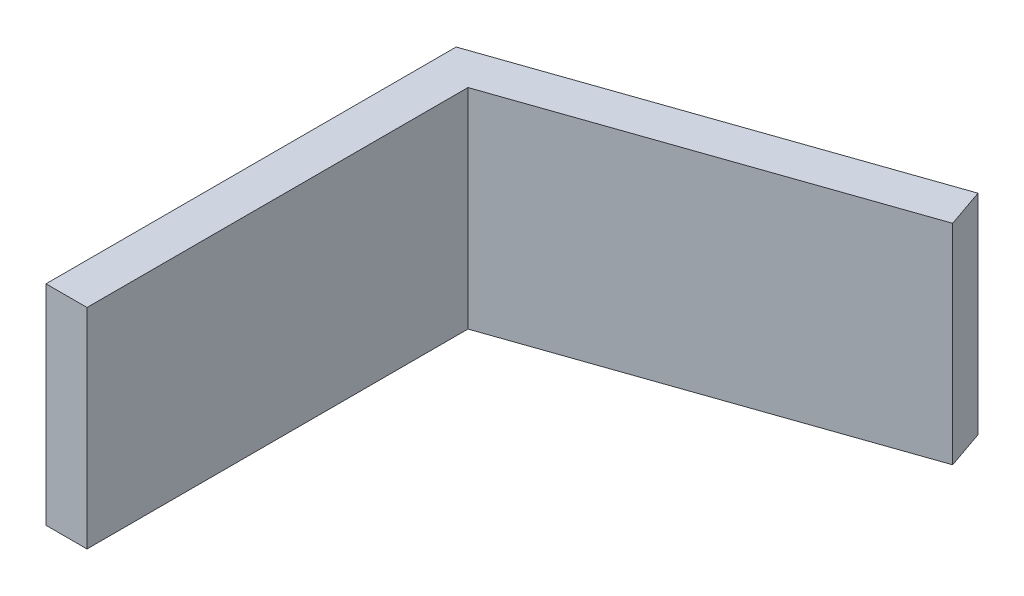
ISO-10303-21;
HEADER;
FILE_DESCRIPTION(('STEP AP214'),'2;1');
FILE_NAME('part.step','',(''),(''),'','','');
FILE_SCHEMA(('AUTOMOTIVE_DESIGN { 1 0 10303 214 1 1 1 1 }'));
ENDSEC;
DATA;
#1=APPLICATION_CONTEXT('core data for automotive mechanical design processes');
#2=APPLICATION_PROTOCOL_DEFINITION('international standard','automotive_design',2000,#1);
#3=PRODUCT_CONTEXT('',#1,'mechanical');
#4=PRODUCT('Part','Part','',(#3));
#5=PRODUCT_RELATED_PRODUCT_CATEGORY('part','',(#4));
#6=PRODUCT_DEFINITION_FORMATION('','',#4);
#7=PRODUCT_DEFINITION_CONTEXT('part definition',#1,'design');
#8=PRODUCT_DEFINITION('design','',#6,#7);
#9=PRODUCT_DEFINITION_SHAPE('','',#8);
#10=(LENGTH_UNIT() NAMED_UNIT(*) SI_UNIT(.MILLI.,.METRE.));
#11=(NAMED_UNIT(*) PLANE_ANGLE_UNIT() SI_UNIT($,.RADIAN.));
#12=(NAMED_UNIT(*) SI_UNIT($,.STERADIAN.) SOLID_ANGLE_UNIT());
#13=UNCERTAINTY_MEASURE_WITH_UNIT(LENGTH_MEASURE(1.E-05),#10,'distance_accuracy_value','');
#14=(GEOMETRIC_REPRESENTATION_CONTEXT(3) GLOBAL_UNCERTAINTY_ASSIGNED_CONTEXT((#13)) GLOBAL_UNIT_ASSIGNED_CONTEXT((#10,
#11,#12)) REPRESENTATION_CONTEXT('',''));
#15=CARTESIAN_POINT('',(0.,0.,0.));
#16=DIRECTION('',(0.,0.,1.));
#17=DIRECTION('',(1.,0.,0.));
#18=AXIS2_PLACEMENT_3D('',#15,#16,#17);
#19=CARTESIAN_POINT('',(-5.00000000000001,25.5,-91.1175916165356));
#20=DIRECTION('',(0.327543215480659,0.,0.944836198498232));
#21=DIRECTION('',(0.944836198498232,0.,-0.327543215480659));
#22=AXIS2_PLACEMENT_3D('',#19,#20,#21);
#23=PLANE('',#22);
#24=DIRECTION('',(-0.944836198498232,0.,0.327543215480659));
#25=VECTOR('',#24,1.);
#26=CARTESIAN_POINT('',(-5.00000000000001,-25.5,-91.1175916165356));
#27=LINE('',#26,#25);
#28=CARTESIAN_POINT('',(89.4836198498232,-25.5,-123.871913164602));
#29=VERTEX_POINT('',#28);
#30=CARTESIAN_POINT('',(-5.00000000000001,-25.5,-91.1175916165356));
#31=VERTEX_POINT('',#30);
#32=EDGE_CURVE('E121',#29,#31,#27,.T.);
#33=ORIENTED_EDGE('',*,*,#32,.T.);
#34=DIRECTION('',(0.,-1.,0.));
#35=VECTOR('',#34,1.);
#36=CARTESIAN_POINT('',(-5.00000000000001,25.5,-91.1175916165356));
#37=LINE('',#36,#35);
#38=CARTESIAN_POINT('',(-5.00000000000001,25.5,-91.1175916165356));
#39=VERTEX_POINT('',#38);
#40=EDGE_CURVE('E11',#39,#31,#37,.T.);
#41=ORIENTED_EDGE('',*,*,#40,.F.);
#42=DIRECTION('',(-0.944836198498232,0.,0.327543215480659));
#43=VECTOR('',#42,1.);
#44=CARTESIAN_POINT('',(-5.00000000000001,25.5,-91.1175916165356));
#45=LINE('',#44,#43);
#46=CARTESIAN_POINT('',(89.4836198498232,25.5,-123.871913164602));
#47=VERTEX_POINT('',#46);
#48=EDGE_CURVE('E131',#47,#39,#45,.T.);
#49=ORIENTED_EDGE('',*,*,#48,.F.);
#50=DIRECTION('',(0.,-1.,0.));
#51=VECTOR('',#50,1.);
#52=CARTESIAN_POINT('',(89.4836198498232,25.5,-123.871913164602));
#53=LINE('',#52,#51);
#54=EDGE_CURVE('E117',#47,#29,#53,.T.);
#55=ORIENTED_EDGE('',*,*,#54,.T.);
#56=EDGE_LOOP('',(#33,#41,#49,#55));
#57=FACE_BOUND('',#56,.T.);
#58=ADVANCED_FACE('F37',(#57),#23,.F.);
#59=CARTESIAN_POINT('',(-5.00000000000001,25.5,-91.1175916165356));
#60=DIRECTION('',(1.,0.,0.));
#61=DIRECTION('',(0.,0.,-1.));
#62=AXIS2_PLACEMENT_3D('',#59,#60,#61);
#63=PLANE('',#62);
#64=DIRECTION('',(0.,0.,1.));
#65=VECTOR('',#64,1.);
#66=CARTESIAN_POINT('',(-5.00000000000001,-25.5,-91.1175916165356));
#67=LINE('',#66,#65);
#68=CARTESIAN_POINT('',(-5.,-25.5,8.88240838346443));
#69=VERTEX_POINT('',#68);
#70=EDGE_CURVE('E124',#31,#69,#67,.T.);
#71=ORIENTED_EDGE('',*,*,#70,.T.);
#72=DIRECTION('',(0.,-1.,0.));
#73=VECTOR('',#72,1.);
#74=CARTESIAN_POINT('',(-5.,25.5,8.88240838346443));
#75=LINE('',#74,#73);
#76=CARTESIAN_POINT('',(-5.,25.5,8.88240838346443));
#77=VERTEX_POINT('',#76);
#78=EDGE_CURVE('E45',#77,#69,#75,.T.);
#79=ORIENTED_EDGE('',*,*,#78,.F.);
#80=DIRECTION('',(0.,0.,1.));
#81=VECTOR('',#80,1.);
#82=CARTESIAN_POINT('',(-5.00000000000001,25.5,-91.1175916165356));
#83=LINE('',#82,#81);
#84=EDGE_CURVE('E90',#39,#77,#83,.T.);
#85=ORIENTED_EDGE('',*,*,#84,.F.);
#86=ORIENTED_EDGE('',*,*,#40,.T.);
#87=EDGE_LOOP('',(#71,#79,#85,#86));
#88=FACE_BOUND('',#87,.T.);
#89=ADVANCED_FACE('F155',(#88),#63,.F.);
#90=CARTESIAN_POINT('',(-5.,25.5,8.88240838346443));
#91=DIRECTION('',(0.,0.,-1.));
#92=DIRECTION('',(-1.,0.,0.));
#93=AXIS2_PLACEMENT_3D('',#90,#91,#92);
#94=PLANE('',#93);
#95=DIRECTION('',(1.,0.,0.));
#96=VECTOR('',#95,1.);
#97=CARTESIAN_POINT('',(-5.,-25.5,8.88240838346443));
#98=LINE('',#97,#96);
#99=CARTESIAN_POINT('',(4.99999999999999,-25.5,8.88240838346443));
#100=VERTEX_POINT('',#99);
#101=EDGE_CURVE('E126',#69,#100,#98,.T.);
#102=ORIENTED_EDGE('',*,*,#101,.T.);
#103=DIRECTION('',(0.,-1.,0.));
#104=VECTOR('',#103,1.);
#105=CARTESIAN_POINT('',(4.99999999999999,25.5,8.88240838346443));
#106=LINE('',#105,#104);
#107=CARTESIAN_POINT('',(4.99999999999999,25.5,8.88240838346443));
#108=VERTEX_POINT('',#107);
#109=EDGE_CURVE('E112',#108,#100,#106,.T.);
#110=ORIENTED_EDGE('',*,*,#109,.F.);
#111=DIRECTION('',(1.,0.,0.));
#112=VECTOR('',#111,1.);
#113=CARTESIAN_POINT('',(-5.,25.5,8.88240838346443));
#114=LINE('',#113,#112);
#115=EDGE_CURVE('E103',#77,#108,#114,.T.);
#116=ORIENTED_EDGE('',*,*,#115,.F.);
#117=ORIENTED_EDGE('',*,*,#78,.T.);
#118=EDGE_LOOP('',(#102,#110,#116,#117));
#119=FACE_BOUND('',#118,.T.);
#120=ADVANCED_FACE('F137',(#119),#94,.F.);
#121=CARTESIAN_POINT('',(5.,25.5,-84.0004131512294));
#122=DIRECTION('',(-1.,0.,0.));
#123=DIRECTION('',(0.,0.,1.));
#124=AXIS2_PLACEMENT_3D('',#121,#122,#123);
#125=PLANE('',#124);
#126=DIRECTION('',(0.,0.,-1.));
#127=VECTOR('',#126,1.);
#128=CARTESIAN_POINT('',(5.,-25.5,-84.0004131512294));
#129=LINE('',#128,#127);
#130=CARTESIAN_POINT('',(5.,-25.5,-84.0004131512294));
#131=VERTEX_POINT('',#130);
#132=EDGE_CURVE('E111',#100,#131,#129,.T.);
#133=ORIENTED_EDGE('',*,*,#132,.T.);
#134=DIRECTION('',(0.,-1.,0.));
#135=VECTOR('',#134,1.);
#136=CARTESIAN_POINT('',(5.,25.5,-84.0004131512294));
#137=LINE('',#136,#135);
#138=CARTESIAN_POINT('',(5.,25.5,-84.0004131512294));
#139=VERTEX_POINT('',#138);
#140=EDGE_CURVE('E108',#139,#131,#137,.T.);
#141=ORIENTED_EDGE('',*,*,#140,.F.);
#142=DIRECTION('',(0.,0.,-1.));
#143=VECTOR('',#142,1.);
#144=CARTESIAN_POINT('',(5.,25.5,-84.0004131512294));
#145=LINE('',#144,#143);
#146=EDGE_CURVE('E97',#108,#139,#145,.T.);
#147=ORIENTED_EDGE('',*,*,#146,.F.);
#148=ORIENTED_EDGE('',*,*,#109,.T.);
#149=EDGE_LOOP('',(#133,#141,#147,#148));
#150=FACE_BOUND('',#149,.T.);
#151=ADVANCED_FACE('F109',(#150),#125,.F.);
#152=CARTESIAN_POINT('',(5.,25.5,-84.0004131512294));
#153=DIRECTION('',(-0.327543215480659,0.,-0.944836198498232));
#154=DIRECTION('',(-0.944836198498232,0.,0.327543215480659));
#155=AXIS2_PLACEMENT_3D('',#152,#153,#154);
#156=PLANE('',#155);
#157=DIRECTION('',(0.944836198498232,0.,-0.327543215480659));
#158=VECTOR('',#157,1.);
#159=CARTESIAN_POINT('',(5.,-25.5,-84.0004131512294));
#160=LINE('',#159,#158);
#161=CARTESIAN_POINT('',(92.7590520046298,-25.5,-114.423551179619));
#162=VERTEX_POINT('',#161);
#163=EDGE_CURVE('E76',#131,#162,#160,.T.);
#164=ORIENTED_EDGE('',*,*,#163,.T.);
#165=DIRECTION('',(0.,-1.,0.));
#166=VECTOR('',#165,1.);
#167=CARTESIAN_POINT('',(92.7590520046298,25.5,-114.423551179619));
#168=LINE('',#167,#166);
#169=CARTESIAN_POINT('',(92.7590520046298,25.5,-114.423551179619));
#170=VERTEX_POINT('',#169);
#171=EDGE_CURVE('E113',#170,#162,#168,.T.);
#172=ORIENTED_EDGE('',*,*,#171,.F.);
#173=DIRECTION('',(0.944836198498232,0.,-0.327543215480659));
#174=VECTOR('',#173,1.);
#175=CARTESIAN_POINT('',(5.,25.5,-84.0004131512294));
#176=LINE('',#175,#174);
#177=EDGE_CURVE('E101',#139,#170,#176,.T.);
#178=ORIENTED_EDGE('',*,*,#177,.F.);
#179=ORIENTED_EDGE('',*,*,#140,.T.);
#180=EDGE_LOOP('',(#164,#172,#178,#179));
#181=FACE_BOUND('',#180,.T.);
#182=ADVANCED_FACE('F115',(#181),#156,.F.);
#183=CARTESIAN_POINT('',(89.4836198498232,25.5,-123.871913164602));
#184=DIRECTION('',(-0.944836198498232,0.,0.32754321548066));
#185=DIRECTION('',(0.32754321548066,0.,0.944836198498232));
#186=AXIS2_PLACEMENT_3D('',#183,#184,#185);
#187=PLANE('',#186);
#188=DIRECTION('',(-0.32754321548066,0.,-0.944836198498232));
#189=VECTOR('',#188,1.);
#190=CARTESIAN_POINT('',(89.4836198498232,-25.5,-123.871913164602));
#191=LINE('',#190,#189);
#192=EDGE_CURVE('E82',#162,#29,#191,.T.);
#193=ORIENTED_EDGE('',*,*,#192,.T.);
#194=ORIENTED_EDGE('',*,*,#54,.F.);
#195=DIRECTION('',(-0.32754321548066,0.,-0.944836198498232));
#196=VECTOR('',#195,1.);
#197=CARTESIAN_POINT('',(89.4836198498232,25.5,-123.871913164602));
#198=LINE('',#197,#196);
#199=EDGE_CURVE('E53',#170,#47,#198,.T.);
#200=ORIENTED_EDGE('',*,*,#199,.F.);
#201=ORIENTED_EDGE('',*,*,#171,.T.);
#202=EDGE_LOOP('',(#193,#194,#200,#201));
#203=FACE_BOUND('',#202,.T.);
#204=ADVANCED_FACE('F144',(#203),#187,.F.);
#205=CARTESIAN_POINT('',(0.,25.5,0.));
#206=DIRECTION('',(0.,-1.,0.));
#207=DIRECTION('',(0.,0.,-1.));
#208=AXIS2_PLACEMENT_3D('',#205,#206,#207);
#209=PLANE('',#208);
#210=ORIENTED_EDGE('',*,*,#48,.T.);
#211=ORIENTED_EDGE('',*,*,#84,.T.);
#212=ORIENTED_EDGE('',*,*,#115,.T.);
#213=ORIENTED_EDGE('',*,*,#146,.T.);
#214=ORIENTED_EDGE('',*,*,#177,.T.);
#215=ORIENTED_EDGE('',*,*,#199,.T.);
#216=EDGE_LOOP('',(#210,#211,#212,#213,#214,#215));
#217=FACE_BOUND('',#216,.T.);
#218=ADVANCED_FACE('F99',(#217),#209,.F.);
#219=CARTESIAN_POINT('',(0.,-25.5,0.));
#220=DIRECTION('',(0.,-1.,0.));
#221=DIRECTION('',(0.,0.,-1.));
#222=AXIS2_PLACEMENT_3D('',#219,#220,#221);
#223=PLANE('',#222);
#224=ORIENTED_EDGE('',*,*,#32,.F.);
#225=ORIENTED_EDGE('',*,*,#192,.F.);
#226=ORIENTED_EDGE('',*,*,#163,.F.);
#227=ORIENTED_EDGE('',*,*,#132,.F.);
#228=ORIENTED_EDGE('',*,*,#101,.F.);
#229=ORIENTED_EDGE('',*,*,#70,.F.);
#230=EDGE_LOOP('',(#224,#225,#226,#227,#228,#229));
#231=FACE_BOUND('',#230,.T.);
#232=ADVANCED_FACE('F140',(#231),#223,.T.);
#233=CLOSED_SHELL('',(#58,#89,#120,#151,#182,#204,#218,#232));
#234=MANIFOLD_SOLID_BREP('B2',#233);
#235=ADVANCED_BREP_SHAPE_REPRESENTATION('',(#18,#234),#14);
#236=SHAPE_DEFINITION_REPRESENTATION(#9,#235);
ENDSEC;
END-ISO-10303-21;
